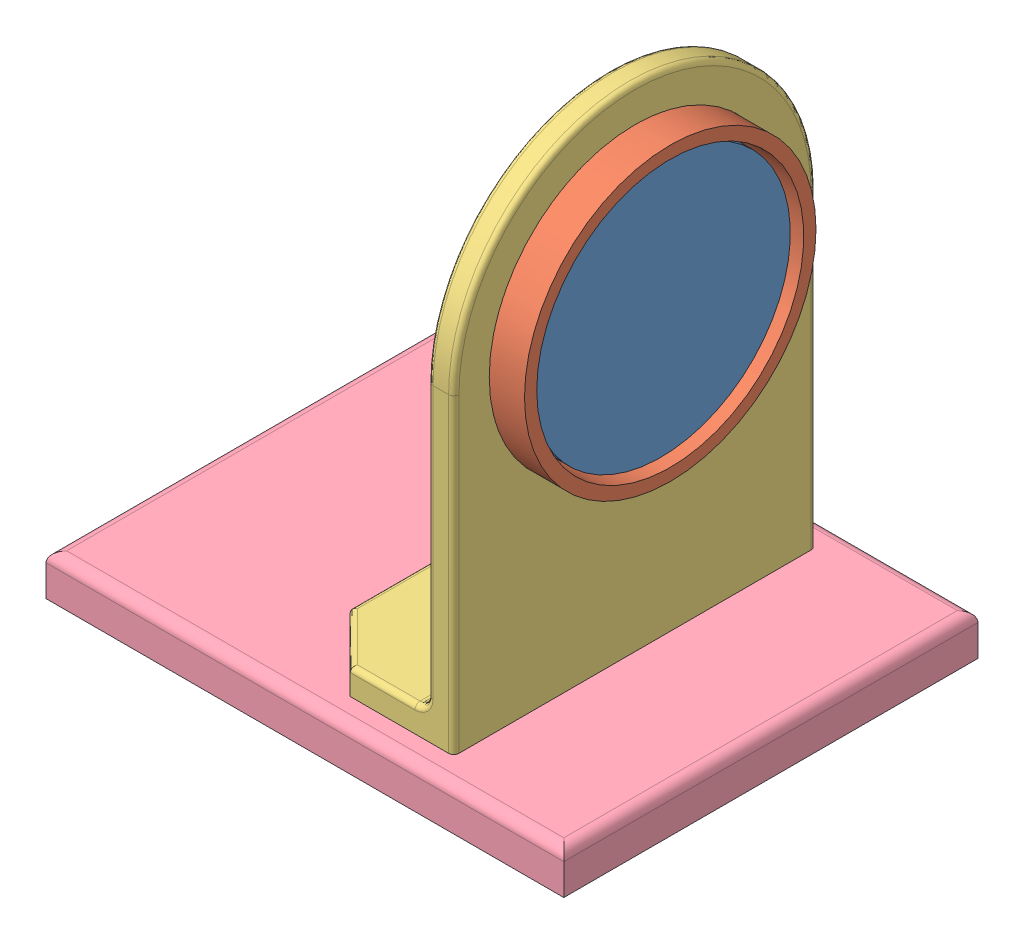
SolidWorks assembly Window-Holder-Stand.SLDASM, configuration Default (file format 3400). Lengths in mm.
Overall size (127 130.81 101.6).
4 component instances, 4 part files, 11 mates.
Components (placement in the parent):
- Window-2: Window.SLDPRT [Default] at origin size (12.7 63.5 63.5)
- Holder-2: Holder.SLDPRT [Default] at origin size (18 75.5 75.5)
- Stand-1: Stand.SLDPRT [Default] x (0 0 -1) z (1 0 0) size (88.9 120.65 38.1)
- Base-1: Base.SLDPRT [Default] at (33.3348 -76.2 7.62) x (0 0 -1) z (0 -1 0) size (101.6 127 10.16)
Mates (geometry in assembly coordinates):
- InPlace2: in place: plane of ?
- Coincident4: coincident aligned: plane of ?; plane of assembly
- Coincident5: coincident aligned: plane of ?; moOrthogonalPlaneRef_w of assembly
- Coincident6: coincident anti-aligned: plane of ?; moOrthogonalPlaneRef_w of assembly
- InPlace3: in place: unknown of Stand-1
- Coincident7: coincident aligned: plane of ?; plane of assembly
- Coincident8: coincident aligned: plane of ?; moOrthogonalPlaneRef_w of assembly
- Coincident9: coincident anti-aligned: plane of ?; moOrthogonalPlaneRef_w of assembly
- Coincident13: coincident: plane of Stand-1 through (6.35 -76.2 116.7093) normal (0 -1 0); plane of ? through (-87.6764 -76.2 50.3452) normal (0 1 0)
- Concentric1: concentric: cylinder of Stand-1; cylinder of ?
- Concentric2: concentric aligned: cylinder of ?; cylinder of ?
